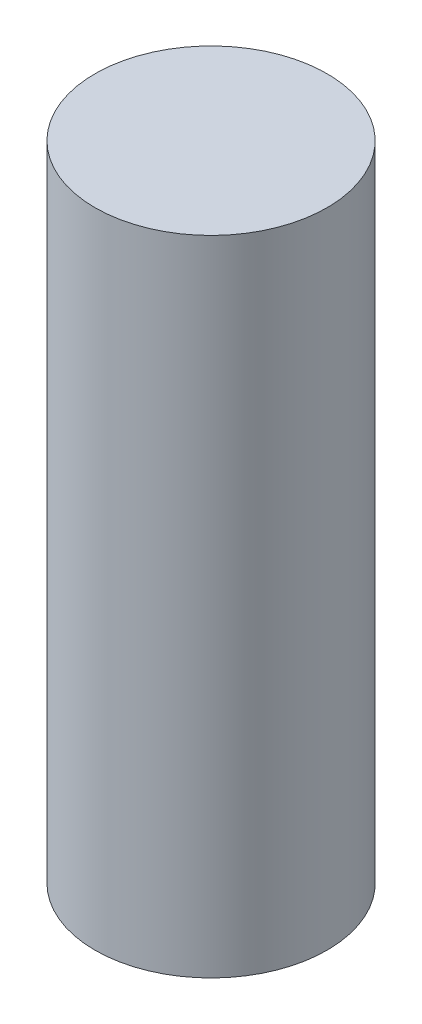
ISO-10303-21;
HEADER;
FILE_DESCRIPTION(('STEP AP214'),'2;1');
FILE_NAME('part.step','',(''),(''),'','','');
FILE_SCHEMA(('AUTOMOTIVE_DESIGN { 1 0 10303 214 1 1 1 1 }'));
ENDSEC;
DATA;
#1=APPLICATION_CONTEXT('core data for automotive mechanical design processes');
#2=APPLICATION_PROTOCOL_DEFINITION('international standard','automotive_design',2000,#1);
#3=PRODUCT_CONTEXT('',#1,'mechanical');
#4=PRODUCT('Part','Part','',(#3));
#5=PRODUCT_RELATED_PRODUCT_CATEGORY('part','',(#4));
#6=PRODUCT_DEFINITION_FORMATION('','',#4);
#7=PRODUCT_DEFINITION_CONTEXT('part definition',#1,'design');
#8=PRODUCT_DEFINITION('design','',#6,#7);
#9=PRODUCT_DEFINITION_SHAPE('','',#8);
#10=(LENGTH_UNIT() NAMED_UNIT(*) SI_UNIT(.MILLI.,.METRE.));
#11=(NAMED_UNIT(*) PLANE_ANGLE_UNIT() SI_UNIT($,.RADIAN.));
#12=(NAMED_UNIT(*) SI_UNIT($,.STERADIAN.) SOLID_ANGLE_UNIT());
#13=UNCERTAINTY_MEASURE_WITH_UNIT(LENGTH_MEASURE(1.E-05),#10,'distance_accuracy_value','');
#14=(GEOMETRIC_REPRESENTATION_CONTEXT(3) GLOBAL_UNCERTAINTY_ASSIGNED_CONTEXT((#13)) GLOBAL_UNIT_ASSIGNED_CONTEXT((#10,
#11,#12)) REPRESENTATION_CONTEXT('',''));
#15=CARTESIAN_POINT('',(0.,0.,0.));
#16=DIRECTION('',(0.,0.,1.));
#17=DIRECTION('',(1.,0.,0.));
#18=AXIS2_PLACEMENT_3D('',#15,#16,#17);
#19=CARTESIAN_POINT('',(0.,200.,0.));
#20=DIRECTION('',(0.,-1.,0.));
#21=DIRECTION('',(0.,0.,-1.));
#22=AXIS2_PLACEMENT_3D('',#19,#20,#21);
#23=CYLINDRICAL_SURFACE('',#22,36.0938420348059);
#24=CARTESIAN_POINT('',(0.,200.,0.));
#25=DIRECTION('',(0.,1.,0.));
#26=DIRECTION('',(0.,0.,1.));
#27=AXIS2_PLACEMENT_3D('',#24,#25,#26);
#28=CIRCLE('',#27,36.0938420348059);
#29=CARTESIAN_POINT('',(0.,200.,36.0938420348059));
#30=VERTEX_POINT('',#29);
#31=EDGE_CURVE('E10',#30,#30,#28,.T.);
#32=ORIENTED_EDGE('',*,*,#31,.F.);
#33=EDGE_LOOP('',(#32));
#34=FACE_BOUND('',#33,.T.);
#35=CARTESIAN_POINT('',(0.,0.,0.));
#36=DIRECTION('',(0.,1.,0.));
#37=DIRECTION('',(0.,0.,1.));
#38=AXIS2_PLACEMENT_3D('',#35,#36,#37);
#39=CIRCLE('',#38,36.0938420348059);
#40=CARTESIAN_POINT('',(0.,0.,36.0938420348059));
#41=VERTEX_POINT('',#40);
#42=EDGE_CURVE('E33',#41,#41,#39,.T.);
#43=ORIENTED_EDGE('',*,*,#42,.T.);
#44=EDGE_LOOP('',(#43));
#45=FACE_BOUND('',#44,.T.);
#46=ADVANCED_FACE('F30',(#34,#45),#23,.T.);
#47=CARTESIAN_POINT('',(0.,200.,0.));
#48=DIRECTION('',(0.,1.,0.));
#49=DIRECTION('',(0.,0.,1.));
#50=AXIS2_PLACEMENT_3D('',#47,#48,#49);
#51=PLANE('',#50);
#52=ORIENTED_EDGE('',*,*,#31,.T.);
#53=EDGE_LOOP('',(#52));
#54=FACE_BOUND('',#53,.T.);
#55=ADVANCED_FACE('F45',(#54),#51,.T.);
#56=CARTESIAN_POINT('',(0.,0.,0.));
#57=DIRECTION('',(0.,1.,0.));
#58=DIRECTION('',(0.,0.,1.));
#59=AXIS2_PLACEMENT_3D('',#56,#57,#58);
#60=PLANE('',#59);
#61=ORIENTED_EDGE('',*,*,#42,.F.);
#62=EDGE_LOOP('',(#61));
#63=FACE_BOUND('',#62,.T.);
#64=ADVANCED_FACE('F43',(#63),#60,.F.);
#65=CLOSED_SHELL('',(#46,#55,#64));
#66=MANIFOLD_SOLID_BREP('B2',#65);
#67=ADVANCED_BREP_SHAPE_REPRESENTATION('',(#18,#66),#14);
#68=SHAPE_DEFINITION_REPRESENTATION(#9,#67);
ENDSEC;
END-ISO-10303-21;
